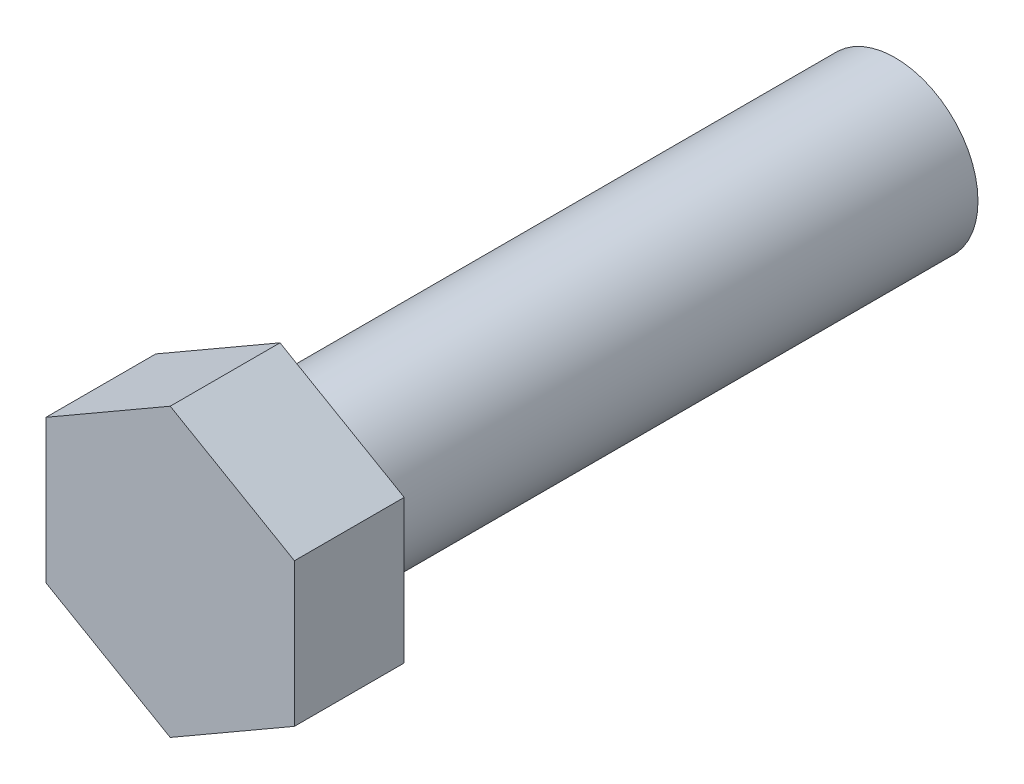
from build123d import *

# Parameters (mm, degrees)
BOLT_HEAD_DEPTH = 29.464
SK_BODY_R       = 22.225
BOLT_BODY_DEPTH = 165.1


with BuildPart() as part:
    # Sketch3 → bolt Head (new body)
    with BuildSketch(Plane(origin=(0, 0, 0), x_dir=(0, 1, 0), z_dir=(0, 0, 1))):
        Polygon((38.494829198, 0), (19.247414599, 33.3375), (-19.247414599, 33.3375), (-38.494829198, 0), (-19.247414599, -33.3375), (19.247414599, -33.3375), align=None)
    extrude(amount=BOLT_HEAD_DEPTH)

    # sk body → bolt Body (add)
    with BuildSketch(Plane(origin=(0, 0, 0), x_dir=(0, 1, 0), z_dir=(0, 0, 1))):
        with Locations(Location((0, 0, 0), (0, 0, 270))):
            Circle(SK_BODY_R)
    extrude(amount=-BOLT_BODY_DEPTH)


solid = part.part
